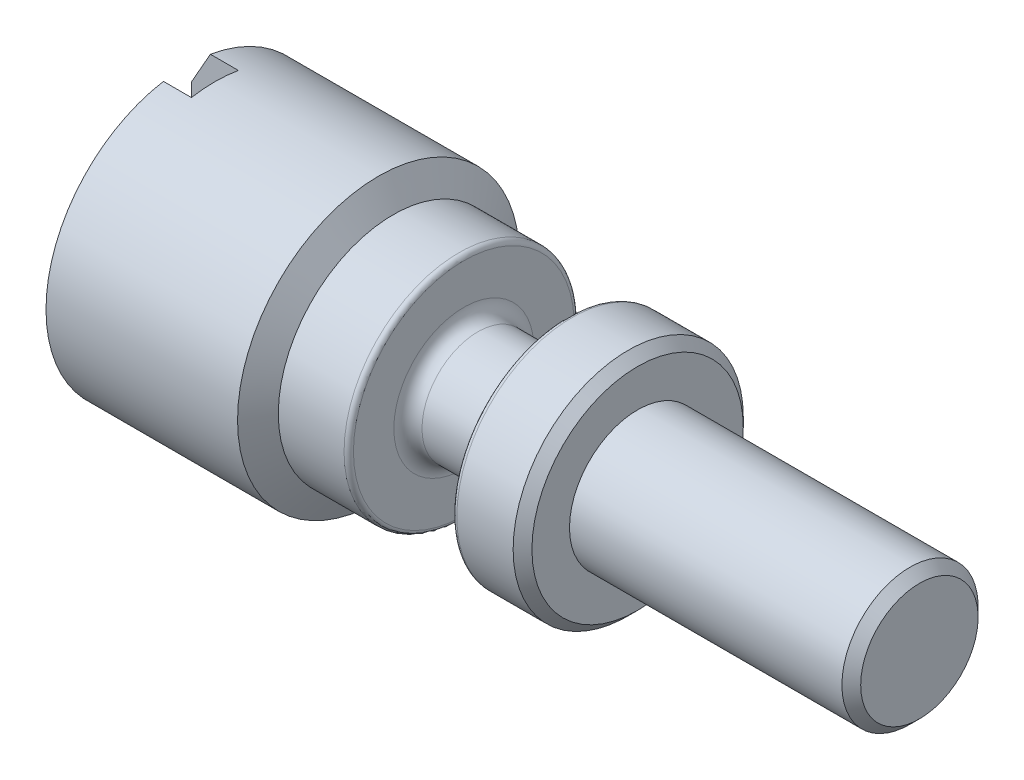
from build123d import *

# Parameters (mm, degrees)
CHANFREIN1_SIZE         = 0.2
CONG_1_R                = 0.3
ESQUISSE2_R             = 0.8
ESQUISSE4_W             = 1
ESQUISSE4_H             = 1
ENL_V_MAT_EXTRU_2_DEPTH = 4.5
CONG_2_R                = 0.1


with BuildPart() as part:
    # Esquisse1 → R_volution1 (revolve)
    with BuildSketch(Plane.XY, mode=Mode.PRIVATE) as r_volution1_sk:
        Polygon((0, 2.3), (0, 0), (16, 0), (16, 1.45), (10, 1.45), (10, 2.45), (8.5, 2.45), (8.5, 1.19), (6.3, 1.19), (6.3, 2.45), (4.8, 2.45), (4.482457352, 3), (0.404145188, 3), align=None)
    revolve(r_volution1_sk.sketch.rotate(Axis((-5.4550242, 0, 0), (1, 0, 0)), 90), axis=Axis((-5.4550242, 0, 0), (1, 0, 0)))

    # Chanfrein1
    chanfrein1_edges = [part.edges().sort_by_distance(p)[0] for p in [
        (16, 0, -1.45),
        (10, 0, -2.45),
    ]]
    chamfer(chanfrein1_edges, length=CHANFREIN1_SIZE)

    # Cong_1
    cong_1_edges = [part.edges().sort_by_distance(p)[0] for p in [
        (8.5, 0, -1.19),
        (6.3, 0, -1.19),
    ]]
    fillet(cong_1_edges, radius=CONG_1_R)

    # Esquisse4 → Enl_v. mat.-Extru.2 (cut, symmetric)
    with BuildSketch(Plane(origin=(0, 0, 0), x_dir=(1, 0, 0), z_dir=(0, 1, 0))):
        with Locations((0.5, 0)):
            Rectangle(ESQUISSE4_W, ESQUISSE4_H)
    extrude(amount=ENL_V_MAT_EXTRU_2_DEPTH, both=True, mode=Mode.SUBTRACT)

    # Cong_2
    cong_2_edges = [part.edges().sort_by_distance(p)[0] for p in [
        (6.3, 0, -2.45),
        (8.5, 0, -2.45),
    ]]
    fillet(cong_2_edges, radius=CONG_2_R)


with BuildPart() as body_2:
    # Esquisse2 → R_volution2 (revolve)
    with BuildSketch(Plane.XY, mode=Mode.PRIVATE) as r_volution2_sk:
        with Locations((7.1, 1.9)):
            Circle(ESQUISSE2_R)
    revolve(r_volution2_sk.sketch.rotate(Axis((-5.4550242, 0, 0), (1, 0, 0)), 270), axis=Axis((-5.4550242, 0, 0), (1, 0, 0)))


solid = part.part
